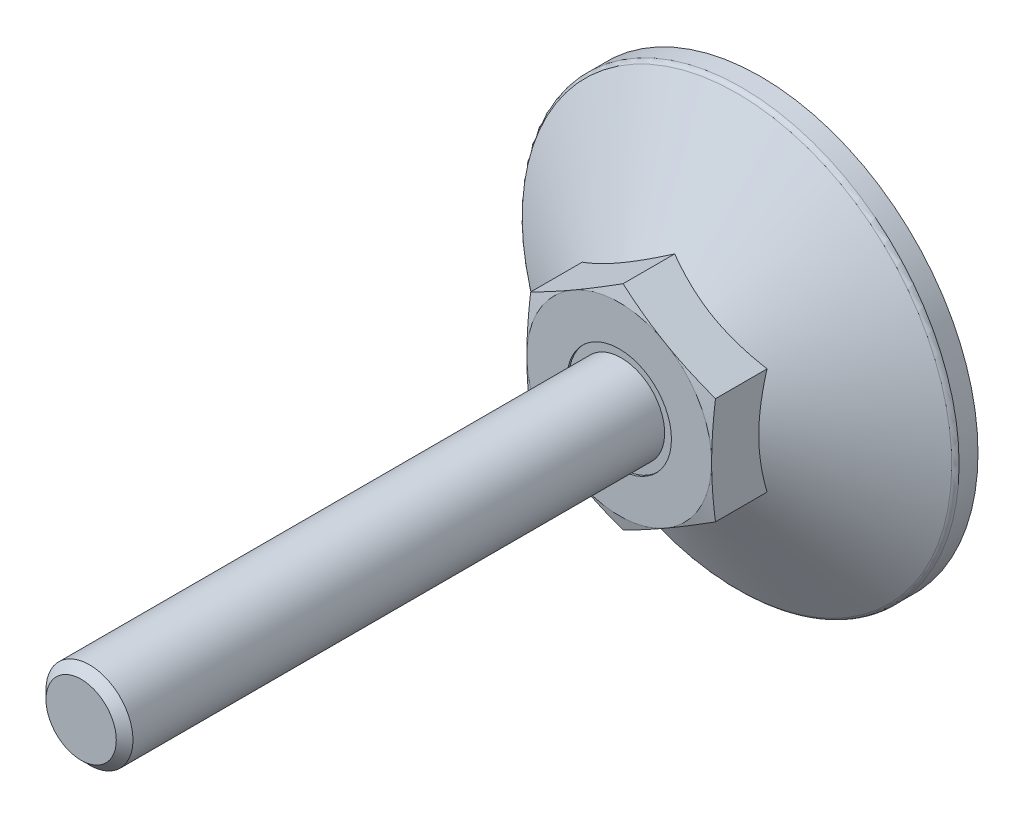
ISO-10303-21;
HEADER;
FILE_DESCRIPTION(('STEP AP214'),'2;1');
FILE_NAME('part.step','',(''),(''),'','','');
FILE_SCHEMA(('AUTOMOTIVE_DESIGN { 1 0 10303 214 1 1 1 1 }'));
ENDSEC;
DATA;
#1=APPLICATION_CONTEXT('core data for automotive mechanical design processes');
#2=APPLICATION_PROTOCOL_DEFINITION('international standard','automotive_design',2000,#1);
#3=PRODUCT_CONTEXT('',#1,'mechanical');
#4=PRODUCT('Part','Part','',(#3));
#5=PRODUCT_RELATED_PRODUCT_CATEGORY('part','',(#4));
#6=PRODUCT_DEFINITION_FORMATION('','',#4);
#7=PRODUCT_DEFINITION_CONTEXT('part definition',#1,'design');
#8=PRODUCT_DEFINITION('design','',#6,#7);
#9=PRODUCT_DEFINITION_SHAPE('','',#8);
#10=(LENGTH_UNIT() NAMED_UNIT(*) SI_UNIT(.MILLI.,.METRE.));
#11=(NAMED_UNIT(*) PLANE_ANGLE_UNIT() SI_UNIT($,.RADIAN.));
#12=(NAMED_UNIT(*) SI_UNIT($,.STERADIAN.) SOLID_ANGLE_UNIT());
#13=UNCERTAINTY_MEASURE_WITH_UNIT(LENGTH_MEASURE(1.E-05),#10,'distance_accuracy_value','');
#14=(GEOMETRIC_REPRESENTATION_CONTEXT(3) GLOBAL_UNCERTAINTY_ASSIGNED_CONTEXT((#13)) GLOBAL_UNIT_ASSIGNED_CONTEXT((#10,
#11,#12)) REPRESENTATION_CONTEXT('',''));
#15=CARTESIAN_POINT('',(0.,0.,0.));
#16=DIRECTION('',(0.,0.,1.));
#17=DIRECTION('',(1.,0.,0.));
#18=AXIS2_PLACEMENT_3D('',#15,#16,#17);
#19=CARTESIAN_POINT('',(0.,9.8149545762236,27.));
#20=DIRECTION('',(0.5,-0.86602540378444,0.));
#21=DIRECTION('',(0.86602540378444,0.5,0.));
#22=AXIS2_PLACEMENT_3D('',#19,#20,#21);
#23=PLANE('',#22);
#24=CARTESIAN_POINT('',(0.0002,9.81507004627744,12.6476280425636));
#25=CARTESIAN_POINT('',(-0.352800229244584,9.61126526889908,12.7022599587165));
#26=CARTESIAN_POINT('',(-0.706440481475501,9.40709097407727,12.7518566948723));
#27=CARTESIAN_POINT('',(-1.41496987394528,8.99802133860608,12.8389934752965));
#28=CARTESIAN_POINT('',(-1.76985946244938,8.79312573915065,12.8765286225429));
#29=CARTESIAN_POINT('',(-2.47873586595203,8.38385575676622,12.9373509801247));
#30=CARTESIAN_POINT('',(-2.83271788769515,8.17948414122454,12.9607107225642));
#31=CARTESIAN_POINT('',(-3.5411333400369,7.77048028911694,12.9920337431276));
#32=CARTESIAN_POINT('',(-3.89556667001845,7.56584811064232,13.));
#33=CARTESIAN_POINT('',(-4.60443332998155,7.15658375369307,13.));
#34=CARTESIAN_POINT('',(-4.9588666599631,6.95195157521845,12.9920337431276));
#35=CARTESIAN_POINT('',(-5.66728211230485,6.54294772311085,12.9607107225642));
#36=CARTESIAN_POINT('',(-6.02126413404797,6.33857610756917,12.9373509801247));
#37=CARTESIAN_POINT('',(-6.73014053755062,5.92930612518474,12.8765286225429));
#38=CARTESIAN_POINT('',(-7.08503012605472,5.7244105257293,12.8389934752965));
#39=CARTESIAN_POINT('',(-7.7935595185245,5.31534089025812,12.7518566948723));
#40=CARTESIAN_POINT('',(-8.14719977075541,5.11116659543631,12.7022599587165));
#41=CARTESIAN_POINT('',(-8.5002,4.90736181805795,12.6476280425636));
#42=B_SPLINE_CURVE_WITH_KNOTS('',3,(#24,#25,#26,#27,#28,#29,#30,#31,#32,#33,#34,#35,#36,#37,#38,
#39,#40,#41),.UNSPECIFIED.,.F.,.F.,(4,2,2,2,2,2,2,2,4),(0.,1.23382789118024,2.46815608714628,
3.69611406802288,4.92383440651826,6.15155474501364,7.37951272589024,8.61384092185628,
9.84766881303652),.UNSPECIFIED.);
#43=CARTESIAN_POINT('',(0.,9.8149545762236,12.6476589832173));
#44=VERTEX_POINT('',#43);
#45=CARTESIAN_POINT('',(-4.25,7.36121593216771,13.));
#46=VERTEX_POINT('',#45);
#47=EDGE_CURVE('E269',#44,#46,#42,.T.);
#48=ORIENTED_EDGE('',*,*,#47,.F.);
#49=DIRECTION('',(0.,0.,-1.));
#50=VECTOR('',#49,1.);
#51=CARTESIAN_POINT('',(0.,9.8149545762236,27.));
#52=LINE('',#51,#50);
#53=CARTESIAN_POINT('',(0.,9.8149545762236,7.90533871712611));
#54=VERTEX_POINT('',#53);
#55=EDGE_CURVE('E43',#44,#54,#52,.T.);
#56=ORIENTED_EDGE('',*,*,#55,.T.);
#57=CARTESIAN_POINT('',(-8.5002,4.90736181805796,7.90527204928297));
#58=CARTESIAN_POINT('',(-8.31336077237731,5.0152334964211,7.96754195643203));
#59=CARTESIAN_POINT('',(-8.1258249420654,5.12350735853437,8.02698579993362));
#60=CARTESIAN_POINT('',(-7.74923024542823,5.34093440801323,8.13944298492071));
#61=CARTESIAN_POINT('',(-7.56017075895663,5.45008795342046,8.19245355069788));
#62=CARTESIAN_POINT('',(-6.98996524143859,5.77929626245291,8.34079470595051));
#63=CARTESIAN_POINT('',(-6.60656835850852,6.00065055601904,8.42516916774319));
#64=CARTESIAN_POINT('',(-6.03282233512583,6.33190297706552,8.52410807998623));
#65=CARTESIAN_POINT('',(-5.8441872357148,6.44081150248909,8.55229289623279));
#66=CARTESIAN_POINT('',(-5.46606397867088,6.65912106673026,8.59955401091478));
#67=CARTESIAN_POINT('',(-5.27657589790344,6.76852206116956,8.61863111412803));
#68=CARTESIAN_POINT('',(-4.89727347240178,6.98751241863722,8.64719332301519));
#69=CARTESIAN_POINT('',(-4.70745974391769,7.0971014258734,8.65668931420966));
#70=CARTESIAN_POINT('',(-4.3276569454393,7.31638067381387,8.66588571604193));
#71=CARTESIAN_POINT('',(-4.13766788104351,7.42607091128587,8.66558642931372));
#72=CARTESIAN_POINT('',(-3.78247698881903,7.63114046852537,8.65587362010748));
#73=CARTESIAN_POINT('',(-3.61725009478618,7.7265342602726,8.64764492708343));
#74=CARTESIAN_POINT('',(-3.28718328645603,7.91709842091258,8.62393885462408));
#75=CARTESIAN_POINT('',(-3.12234339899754,8.01226877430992,8.60846098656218));
#76=CARTESIAN_POINT('',(-2.62846189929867,8.29741139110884,8.55151947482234));
#77=CARTESIAN_POINT('',(-2.30029449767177,8.48687892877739,8.49955503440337));
#78=CARTESIAN_POINT('',(-1.64047857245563,8.86782383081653,8.36964315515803));
#79=CARTESIAN_POINT('',(-1.30891425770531,9.0592525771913,8.29114502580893));
#80=CARTESIAN_POINT('',(-0.650730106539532,9.43925537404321,8.11298675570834));
#81=CARTESIAN_POINT('',(-0.324101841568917,9.62783429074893,8.01336845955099));
#82=CARTESIAN_POINT('',(0.000199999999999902,9.81507004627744,7.90527204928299));
#83=B_SPLINE_CURVE_WITH_KNOTS('',3,(#57,#58,#59,#60,#61,#62,#63,#64,#65,#66,#67,#68,#69,#70,#71,
#72,#73,#74,#75,#76,#77,#78,#79,#80,#81,#82),.UNSPECIFIED.,.F.,.F.,(4,2,2,2,2,2,2,2,2,2,2,2,4),
(0.,0.673596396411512,1.34748239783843,2.69805431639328,3.35679995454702,4.01548737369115,
4.67342558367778,5.33134346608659,5.90409556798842,6.47688628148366,7.62328361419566,
8.79510569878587,9.96462743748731),.UNSPECIFIED.);
#84=CARTESIAN_POINT('',(-8.5,4.9074772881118,7.90533871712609));
#85=VERTEX_POINT('',#84);
#86=EDGE_CURVE('E237',#85,#54,#83,.T.);
#87=ORIENTED_EDGE('',*,*,#86,.F.);
#88=DIRECTION('',(0.,0.,-1.));
#89=VECTOR('',#88,1.);
#90=CARTESIAN_POINT('',(-8.5,4.9074772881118,27.));
#91=LINE('',#90,#89);
#92=CARTESIAN_POINT('',(-8.5,4.9074772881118,12.6476589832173));
#93=VERTEX_POINT('',#92);
#94=EDGE_CURVE('E282',#93,#85,#91,.T.);
#95=ORIENTED_EDGE('',*,*,#94,.F.);
#96=EDGE_CURVE('E169',#46,#93,#42,.T.);
#97=ORIENTED_EDGE('',*,*,#96,.F.);
#98=EDGE_LOOP('',(#48,#56,#87,#95,#97));
#99=FACE_BOUND('',#98,.T.);
#100=ADVANCED_FACE('F14',(#99),#23,.F.);
#101=CARTESIAN_POINT('',(8.5,4.9074772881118,27.));
#102=DIRECTION('',(-0.5,-0.86602540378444,0.));
#103=DIRECTION('',(0.86602540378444,-0.5,0.));
#104=AXIS2_PLACEMENT_3D('',#101,#102,#103);
#105=PLANE('',#104);
#106=CARTESIAN_POINT('',(8.5002,4.90736181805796,12.6476280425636));
#107=CARTESIAN_POINT('',(8.14719977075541,5.11116659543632,12.7022599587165));
#108=CARTESIAN_POINT('',(7.7935595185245,5.31534089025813,12.7518566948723));
#109=CARTESIAN_POINT('',(7.08503012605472,5.72441052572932,12.8389934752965));
#110=CARTESIAN_POINT('',(6.73014053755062,5.92930612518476,12.8765286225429));
#111=CARTESIAN_POINT('',(6.02126413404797,6.33857610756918,12.9373509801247));
#112=CARTESIAN_POINT('',(5.66728211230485,6.54294772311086,12.9607107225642));
#113=CARTESIAN_POINT('',(4.9588666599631,6.95195157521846,12.9920337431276));
#114=CARTESIAN_POINT('',(4.60443332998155,7.15658375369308,13.));
#115=CARTESIAN_POINT('',(3.89556667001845,7.56584811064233,13.));
#116=CARTESIAN_POINT('',(3.5411333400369,7.77048028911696,12.9920337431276));
#117=CARTESIAN_POINT('',(2.83271788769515,8.17948414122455,12.9607107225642));
#118=CARTESIAN_POINT('',(2.47873586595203,8.38385575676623,12.9373509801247));
#119=CARTESIAN_POINT('',(1.76985946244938,8.79312573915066,12.8765286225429));
#120=CARTESIAN_POINT('',(1.41496987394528,8.9980213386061,12.8389934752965));
#121=CARTESIAN_POINT('',(0.706440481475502,9.40709097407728,12.7518566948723));
#122=CARTESIAN_POINT('',(0.352800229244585,9.61126526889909,12.7022599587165));
#123=CARTESIAN_POINT('',(-0.000200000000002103,9.81507004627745,12.6476280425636));
#124=B_SPLINE_CURVE_WITH_KNOTS('',3,(#106,#107,#108,#109,#110,#111,#112,#113,#114,#115,#116,
#117,#118,#119,#120,#121,#122,#123),.UNSPECIFIED.,.F.,.F.,(4,2,2,2,2,2,2,2,4),(0.,
1.23382789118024,2.46815608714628,3.69611406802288,4.92383440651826,6.15155474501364,
7.37951272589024,8.61384092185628,9.84766881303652),.UNSPECIFIED.);
#125=CARTESIAN_POINT('',(8.5,4.9074772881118,12.6476589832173));
#126=VERTEX_POINT('',#125);
#127=CARTESIAN_POINT('',(4.25,7.36121593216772,13.));
#128=VERTEX_POINT('',#127);
#129=EDGE_CURVE('E121',#126,#128,#124,.T.);
#130=ORIENTED_EDGE('',*,*,#129,.F.);
#131=DIRECTION('',(0.,0.,-1.));
#132=VECTOR('',#131,1.);
#133=CARTESIAN_POINT('',(8.5,4.9074772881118,27.));
#134=LINE('',#133,#132);
#135=CARTESIAN_POINT('',(8.5,4.9074772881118,7.90533871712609));
#136=VERTEX_POINT('',#135);
#137=EDGE_CURVE('E128',#126,#136,#134,.T.);
#138=ORIENTED_EDGE('',*,*,#137,.T.);
#139=CARTESIAN_POINT('',(-0.0002,9.81507004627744,7.90527204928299));
#140=CARTESIAN_POINT('',(0.186639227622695,9.7071983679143,7.96754195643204));
#141=CARTESIAN_POINT('',(0.374175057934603,9.59892450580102,8.02698579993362));
#142=CARTESIAN_POINT('',(0.750769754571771,9.38149745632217,8.13944298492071));
#143=CARTESIAN_POINT('',(0.939829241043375,9.27234391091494,8.19245355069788));
#144=CARTESIAN_POINT('',(1.51003475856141,8.94313560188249,8.34079470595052));
#145=CARTESIAN_POINT('',(1.89343164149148,8.72178130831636,8.42516916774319));
#146=CARTESIAN_POINT('',(2.46717766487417,8.39052888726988,8.52410807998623));
#147=CARTESIAN_POINT('',(2.6558127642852,8.28162036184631,8.55229289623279));
#148=CARTESIAN_POINT('',(3.03393602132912,8.06331079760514,8.59955401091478));
#149=CARTESIAN_POINT('',(3.22342410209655,7.95390980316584,8.61863111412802));
#150=CARTESIAN_POINT('',(3.60272652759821,7.73491944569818,8.64719332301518));
#151=CARTESIAN_POINT('',(3.79254025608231,7.62533043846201,8.65668931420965));
#152=CARTESIAN_POINT('',(4.1723430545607,7.40605119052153,8.66588571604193));
#153=CARTESIAN_POINT('',(4.36233211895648,7.29636095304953,8.66558642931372));
#154=CARTESIAN_POINT('',(4.71752301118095,7.09129139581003,8.65587362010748));
#155=CARTESIAN_POINT('',(4.88274990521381,6.9958976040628,8.64764492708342));
#156=CARTESIAN_POINT('',(5.21281671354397,6.80533344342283,8.62393885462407));
#157=CARTESIAN_POINT('',(5.37765660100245,6.71016309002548,8.60846098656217));
#158=CARTESIAN_POINT('',(5.87153810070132,6.42502047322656,8.55151947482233));
#159=CARTESIAN_POINT('',(6.19970550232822,6.23555293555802,8.49955503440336));
#160=CARTESIAN_POINT('',(6.85952142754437,5.85460803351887,8.36964315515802));
#161=CARTESIAN_POINT('',(7.19108574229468,5.6631792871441,8.29114502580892));
#162=CARTESIAN_POINT('',(7.84926989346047,5.28317649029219,8.11298675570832));
#163=CARTESIAN_POINT('',(8.17589815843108,5.09459757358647,8.01336845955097));
#164=CARTESIAN_POINT('',(8.5002,4.90736181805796,7.90527204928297));
#165=B_SPLINE_CURVE_WITH_KNOTS('',3,(#139,#140,#141,#142,#143,#144,#145,#146,#147,#148,#149,
#150,#151,#152,#153,#154,#155,#156,#157,#158,#159,#160,#161,#162,#163,#164),.UNSPECIFIED.,.F.,
.F.,(4,2,2,2,2,2,2,2,2,2,2,2,4),(0.,0.673596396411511,1.34748239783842,2.69805431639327,
3.35679995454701,4.01548737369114,4.67342558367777,5.33134346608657,5.90409556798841,
6.47688628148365,7.62328361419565,8.79510569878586,9.96462743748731),.UNSPECIFIED.);
#166=EDGE_CURVE('E231',#54,#136,#165,.T.);
#167=ORIENTED_EDGE('',*,*,#166,.F.);
#168=ORIENTED_EDGE('',*,*,#55,.F.);
#169=EDGE_CURVE('E138',#128,#44,#124,.T.);
#170=ORIENTED_EDGE('',*,*,#169,.F.);
#171=EDGE_LOOP('',(#130,#138,#167,#168,#170));
#172=FACE_BOUND('',#171,.T.);
#173=ADVANCED_FACE('F243',(#172),#105,.F.);
#174=CARTESIAN_POINT('',(8.5,-4.9074772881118,27.));
#175=DIRECTION('',(-1.,0.,0.));
#176=DIRECTION('',(0.,-1.,0.));
#177=AXIS2_PLACEMENT_3D('',#174,#175,#176);
#178=PLANE('',#177);
#179=CARTESIAN_POINT('',(8.5,-13.0021805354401,11.1152320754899));
#180=CARTESIAN_POINT('',(8.5,-12.6163302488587,11.2017460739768));
#181=CARTESIAN_POINT('',(8.5,-12.2302391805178,11.2872053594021));
#182=CARTESIAN_POINT('',(8.5,-11.4574571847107,11.4554451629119));
#183=CARTESIAN_POINT('',(8.5,-11.0707662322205,11.5382255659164));
#184=CARTESIAN_POINT('',(8.5,-10.2963226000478,11.7006097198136));
#185=CARTESIAN_POINT('',(8.5,-9.90856925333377,11.7802103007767));
#186=CARTESIAN_POINT('',(8.5,-9.13225694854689,11.9353788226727));
#187=CARTESIAN_POINT('',(8.5,-8.7436979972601,12.0109467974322));
#188=CARTESIAN_POINT('',(8.5,-7.96872954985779,12.1565076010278));
#189=CARTESIAN_POINT('',(8.5,-7.58232751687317,12.2265399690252));
#190=CARTESIAN_POINT('',(8.5,-6.80847058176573,12.3605125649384));
#191=CARTESIAN_POINT('',(8.5,-6.42101570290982,12.4244529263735));
#192=CARTESIAN_POINT('',(8.5,-5.64497545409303,12.5448060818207));
#193=CARTESIAN_POINT('',(8.5,-5.25639022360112,12.6012197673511));
#194=CARTESIAN_POINT('',(8.5,-4.4779825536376,12.7048608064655));
#195=CARTESIAN_POINT('',(8.5,-4.08816011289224,12.7520881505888));
#196=CARTESIAN_POINT('',(8.5,-3.30287168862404,12.8360235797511));
#197=CARTESIAN_POINT('',(8.5,-2.90739202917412,12.8726056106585));
#198=CARTESIAN_POINT('',(8.5,-2.11543412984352,12.9327294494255));
#199=CARTESIAN_POINT('',(8.5,-1.71895591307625,12.9562715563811));
#200=CARTESIAN_POINT('',(8.5,-0.925576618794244,12.988942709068));
#201=CARTESIAN_POINT('',(8.5,-0.528675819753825,12.9980783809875));
#202=CARTESIAN_POINT('',(8.5,0.265188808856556,13.0013745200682));
#203=CARTESIAN_POINT('',(8.5,0.662152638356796,12.9955350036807));
#204=CARTESIAN_POINT('',(8.5,1.4570313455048,12.969208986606));
#205=CARTESIAN_POINT('',(8.5,1.85494442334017,12.9486692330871));
#206=CARTESIAN_POINT('',(8.5,2.64983744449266,12.8941170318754));
#207=CARTESIAN_POINT('',(8.5,3.0468173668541,12.8601042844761));
#208=CARTESIAN_POINT('',(8.5,3.83984026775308,12.780329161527));
#209=CARTESIAN_POINT('',(8.5,4.23588245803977,12.7345590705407));
#210=CARTESIAN_POINT('',(8.5,5.02669148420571,12.6331799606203));
#211=CARTESIAN_POINT('',(8.5,5.42145831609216,12.5775709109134));
#212=CARTESIAN_POINT('',(8.5,6.18517456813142,12.4620180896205));
#213=CARTESIAN_POINT('',(8.5,6.55419838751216,12.4025610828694));
#214=CARTESIAN_POINT('',(8.5,7.29126861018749,12.2778421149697));
#215=CARTESIAN_POINT('',(8.5,7.65931498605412,12.2125799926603));
#216=CARTESIAN_POINT('',(8.5,8.39456605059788,12.0773157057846));
#217=CARTESIAN_POINT('',(8.5,8.76177065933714,12.0073131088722));
#218=CARTESIAN_POINT('',(8.5,9.49542419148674,11.8634431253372));
#219=CARTESIAN_POINT('',(8.5,9.86187310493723,11.7895756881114));
#220=CARTESIAN_POINT('',(8.5,10.5942023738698,11.6386609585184));
#221=CARTESIAN_POINT('',(8.5,10.9600825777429,11.5616129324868));
#222=CARTESIAN_POINT('',(8.5,11.6912848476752,11.4049086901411));
#223=CARTESIAN_POINT('',(8.5,12.0566069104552,11.3252524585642));
#224=CARTESIAN_POINT('',(8.5,13.1518112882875,11.0830781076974));
#225=CARTESIAN_POINT('',(8.5,13.8809821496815,10.9173438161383));
#226=CARTESIAN_POINT('',(8.5,15.3307543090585,10.5815635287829));
#227=CARTESIAN_POINT('',(8.5,16.051369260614,10.4115760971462));
#228=CARTESIAN_POINT('',(8.5,17.4915955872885,10.0673505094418));
#229=CARTESIAN_POINT('',(8.5,18.2112069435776,9.89311227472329));
#230=CARTESIAN_POINT('',(8.5,19.6487634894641,9.54172135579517));
#231=CARTESIAN_POINT('',(8.5,20.3667096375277,9.36457258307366));
#232=CARTESIAN_POINT('',(8.5,21.8019779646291,9.00786472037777));
#233=CARTESIAN_POINT('',(8.5,22.5193001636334,8.82830571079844));
#234=CARTESIAN_POINT('',(8.5,23.2364053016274,8.64789358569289));
#235=B_SPLINE_CURVE_WITH_KNOTS('',3,(#179,#180,#181,#182,#183,#184,#185,#186,#187,#188,#189,
#190,#191,#192,#193,#194,#195,#196,#197,#198,#199,#200,#201,#202,#203,#204,#205,#206,#207,#208,
#209,#210,#211,#212,#213,#214,#215,#216,#217,#218,#219,#220,#221,#222,#223,#224,#225,#226,#227,
#228,#229,#230,#231,#232,#233,#234),.UNSPECIFIED.,.F.,.F.,(4,2,2,2,2,2,2,2,2,2,2,2,2,2,2,2,2,2,
2,2,2,2,2,2,2,2,2,4),(0.,1.18629567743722,2.37264224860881,3.56014337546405,4.74763453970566,
5.92568709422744,7.10371382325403,8.28160089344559,9.45948917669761,10.6508050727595,
11.84209364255,13.0328341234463,14.2235732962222,15.418647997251,16.613749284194,
17.809636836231,19.0055281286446,20.126822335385,21.2481476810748,22.3695754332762,
23.4910178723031,24.6127204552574,25.7344296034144,27.9776935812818,30.1988572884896,
32.4200621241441,34.6384929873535,36.8568500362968),.UNSPECIFIED.);
#236=CARTESIAN_POINT('',(8.5,-4.90747728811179,12.6476589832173));
#237=VERTEX_POINT('',#236);
#238=CARTESIAN_POINT('',(8.5,0.,13.));
#239=VERTEX_POINT('',#238);
#240=EDGE_CURVE('E95',#237,#239,#235,.T.);
#241=ORIENTED_EDGE('',*,*,#240,.F.);
#242=DIRECTION('',(0.,0.,-1.));
#243=VECTOR('',#242,1.);
#244=CARTESIAN_POINT('',(8.5,-4.9074772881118,27.));
#245=LINE('',#244,#243);
#246=CARTESIAN_POINT('',(8.5,-4.9074772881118,7.90533871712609));
#247=VERTEX_POINT('',#246);
#248=EDGE_CURVE('E275',#237,#247,#245,.T.);
#249=ORIENTED_EDGE('',*,*,#248,.T.);
#250=CARTESIAN_POINT('',(8.5,12.7492767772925,4.72527230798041));
#251=CARTESIAN_POINT('',(8.5,12.3811478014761,4.90206026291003));
#252=CARTESIAN_POINT('',(8.5,12.0121249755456,5.07702151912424));
#253=CARTESIAN_POINT('',(8.5,11.2718137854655,5.42225230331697));
#254=CARTESIAN_POINT('',(8.5,10.9005250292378,5.59252098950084));
#255=CARTESIAN_POINT('',(8.5,10.1530767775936,5.92827896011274));
#256=CARTESIAN_POINT('',(8.5,9.77690140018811,6.09373302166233));
#257=CARTESIAN_POINT('',(8.5,9.02139912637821,6.41725455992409));
#258=CARTESIAN_POINT('',(8.5,8.64207239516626,6.57532242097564));
#259=CARTESIAN_POINT('',(8.5,7.86979942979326,6.88607334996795));
#260=CARTESIAN_POINT('',(8.5,7.47675434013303,7.03851219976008));
#261=CARTESIAN_POINT('',(8.5,6.68591204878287,7.33076935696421));
#262=CARTESIAN_POINT('',(8.5,6.28811429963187,7.47058619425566));
#263=CARTESIAN_POINT('',(8.5,5.48802263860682,7.733611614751));
#264=CARTESIAN_POINT('',(8.5,5.08574124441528,7.85685783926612));
#265=CARTESIAN_POINT('',(8.5,4.27544970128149,8.08251258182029));
#266=CARTESIAN_POINT('',(8.5,3.86744153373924,8.18492812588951));
#267=CARTESIAN_POINT('',(8.5,3.04728386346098,8.36327495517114));
#268=CARTESIAN_POINT('',(8.5,2.6351585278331,8.43931422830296));
#269=CARTESIAN_POINT('',(8.5,2.01359122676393,8.53003978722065));
#270=CARTESIAN_POINT('',(8.5,1.80582110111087,8.55639399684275));
#271=CARTESIAN_POINT('',(8.5,1.38940213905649,8.60080126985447));
#272=CARTESIAN_POINT('',(8.5,1.18075338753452,8.61885511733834));
#273=CARTESIAN_POINT('',(8.5,0.765376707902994,8.64609671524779));
#274=CARTESIAN_POINT('',(8.5,0.558655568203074,8.65538769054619));
#275=CARTESIAN_POINT('',(8.5,0.1450067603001,8.66526416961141));
#276=CARTESIAN_POINT('',(8.5,-0.0619209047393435,8.6658498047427));
#277=CARTESIAN_POINT('',(8.5,-0.475626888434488,8.65830085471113));
#278=CARTESIAN_POINT('',(8.5,-0.682405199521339,8.65016585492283));
#279=CARTESIAN_POINT('',(8.5,-1.09545270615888,8.625363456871));
#280=CARTESIAN_POINT('',(8.5,-1.30172187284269,8.60869558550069));
#281=CARTESIAN_POINT('',(8.5,-1.81090940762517,8.55735076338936));
#282=CARTESIAN_POINT('',(8.5,-2.11335210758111,8.51788364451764));
#283=CARTESIAN_POINT('',(8.5,-2.71570235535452,8.4228634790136));
#284=CARTESIAN_POINT('',(8.5,-3.01560949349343,8.36730788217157));
#285=CARTESIAN_POINT('',(8.5,-3.61268959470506,8.2420877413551));
#286=CARTESIAN_POINT('',(8.5,-3.90986014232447,8.17241178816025));
#287=CARTESIAN_POINT('',(8.5,-4.50108875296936,8.02104250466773));
#288=CARTESIAN_POINT('',(8.5,-4.79514688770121,7.93934945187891));
#289=CARTESIAN_POINT('',(8.5,-5.3871494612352,7.7638116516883));
#290=CARTESIAN_POINT('',(8.5,-5.68502188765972,7.6697256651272));
#291=CARTESIAN_POINT('',(8.5,-6.27782977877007,7.4727599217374));
#292=CARTESIAN_POINT('',(8.5,-6.57276522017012,7.36988009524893));
#293=CARTESIAN_POINT('',(8.5,-7.15987047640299,7.15687683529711));
#294=CARTESIAN_POINT('',(8.5,-7.45204129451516,7.04675615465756));
#295=CARTESIAN_POINT('',(8.5,-8.03401937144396,6.82048197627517));
#296=CARTESIAN_POINT('',(8.5,-8.32382669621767,6.70432864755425));
#297=CARTESIAN_POINT('',(8.5,-8.8985343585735,6.468166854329));
#298=CARTESIAN_POINT('',(8.5,-9.18345493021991,6.34820749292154));
#299=CARTESIAN_POINT('',(8.5,-9.75152375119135,6.10415692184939));
#300=CARTESIAN_POINT('',(8.5,-10.034671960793,5.98006561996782));
#301=CARTESIAN_POINT('',(8.5,-10.8818575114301,5.60257794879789));
#302=CARTESIAN_POINT('',(8.5,-11.4435817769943,5.34399030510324));
#303=CARTESIAN_POINT('',(8.5,-12.5625477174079,4.81675169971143));
#304=CARTESIAN_POINT('',(8.5,-13.1197873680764,4.54809647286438));
#305=CARTESIAN_POINT('',(8.5,-14.2306052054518,4.00340707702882));
#306=CARTESIAN_POINT('',(8.5,-14.7841835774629,3.72737328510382));
#307=CARTESIAN_POINT('',(8.5,-15.8894273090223,3.16924748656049));
#308=CARTESIAN_POINT('',(8.5,-16.4410879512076,2.88714616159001));
#309=CARTESIAN_POINT('',(8.5,-17.5421722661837,2.31860293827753));
#310=CARTESIAN_POINT('',(8.5,-18.0915959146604,2.03216099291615));
#311=CARTESIAN_POINT('',(8.5,-19.1885131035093,1.45593769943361));
#312=CARTESIAN_POINT('',(8.5,-19.7360070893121,1.1661571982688));
#313=CARTESIAN_POINT('',(8.5,-20.8295421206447,0.583866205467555));
#314=CARTESIAN_POINT('',(8.5,-21.3755831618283,0.291355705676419));
#315=CARTESIAN_POINT('',(8.5,-22.8810608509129,-0.519031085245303));
#316=CARTESIAN_POINT('',(8.5,-23.8392547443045,-1.03921546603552));
#317=CARTESIAN_POINT('',(8.5,-25.7530641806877,-2.08445783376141));
#318=CARTESIAN_POINT('',(8.5,-26.708679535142,-2.60951616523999));
#319=CARTESIAN_POINT('',(8.5,-28.6148788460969,-3.66152013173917));
#320=CARTESIAN_POINT('',(8.5,-29.565469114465,-4.18845433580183));
#321=CARTESIAN_POINT('',(8.5,-30.9901906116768,-4.98085413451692));
#322=CARTESIAN_POINT('',(8.5,-31.4648842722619,-5.24530955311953));
#323=CARTESIAN_POINT('',(8.5,-32.4139385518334,-5.77481644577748));
#324=CARTESIAN_POINT('',(8.5,-32.8882991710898,-6.03986791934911));
#325=CARTESIAN_POINT('',(8.5,-33.3625145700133,-6.30517901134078));
#326=B_SPLINE_CURVE_WITH_KNOTS('',3,(#250,#251,#252,#253,#254,#255,#256,#257,#258,#259,#260,
#261,#262,#263,#264,#265,#266,#267,#268,#269,#270,#271,#272,#273,#274,#275,#276,#277,#278,#279,
#280,#281,#282,#283,#284,#285,#286,#287,#288,#289,#290,#291,#292,#293,#294,#295,#296,#297,#298,
#299,#300,#301,#302,#303,#304,#305,#306,#307,#308,#309,#310,#311,#312,#313,#314,#315,#316,#317,
#318,#319,#320,#321,#322,#323,#324,#325),.UNSPECIFIED.,.F.,.F.,(4,2,2,2,2,2,2,2,2,2,2,2,2,2,2,2,
2,2,2,2,2,2,2,2,2,2,2,2,2,2,2,2,2,2,2,2,2,4),(0.,1.22515253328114,2.45052343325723,
3.6833213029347,4.91605495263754,6.18059988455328,7.44529191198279,8.70706073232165,
9.96840325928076,11.2245189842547,11.852683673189,12.4807890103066,13.1013994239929,
13.7220004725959,14.3426310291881,14.9632960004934,15.8778021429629,16.7924533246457,
17.7078465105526,18.6232185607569,19.5601888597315,20.4971665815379,21.433790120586,
22.3703874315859,23.297780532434,24.225194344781,26.0801973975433,27.9359954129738,
29.7916987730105,31.6504906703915,33.5093027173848,35.3676531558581,37.2260091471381,
40.4968499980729,43.7679238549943,47.0285209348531,48.6586852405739,50.2888482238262),.UNSPECIFIED.);
#327=EDGE_CURVE('E197',#136,#247,#326,.T.);
#328=ORIENTED_EDGE('',*,*,#327,.F.);
#329=ORIENTED_EDGE('',*,*,#137,.F.);
#330=EDGE_CURVE('E106',#239,#126,#235,.T.);
#331=ORIENTED_EDGE('',*,*,#330,.F.);
#332=EDGE_LOOP('',(#241,#249,#328,#329,#331));
#333=FACE_BOUND('',#332,.T.);
#334=ADVANCED_FACE('F126',(#333),#178,.F.);
#335=CARTESIAN_POINT('',(0.,-9.8149545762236,27.));
#336=DIRECTION('',(-0.5,0.86602540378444,0.));
#337=DIRECTION('',(-0.86602540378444,-0.5,0.));
#338=AXIS2_PLACEMENT_3D('',#335,#336,#337);
#339=PLANE('',#338);
#340=CARTESIAN_POINT('',(-0.0002,-9.81507004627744,12.6476280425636));
#341=CARTESIAN_POINT('',(0.352800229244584,-9.61126526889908,12.7022599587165));
#342=CARTESIAN_POINT('',(0.706440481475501,-9.40709097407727,12.7518566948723));
#343=CARTESIAN_POINT('',(1.41496987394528,-8.99802133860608,12.8389934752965));
#344=CARTESIAN_POINT('',(1.76985946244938,-8.79312573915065,12.8765286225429));
#345=CARTESIAN_POINT('',(2.47873586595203,-8.38385575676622,12.9373509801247));
#346=CARTESIAN_POINT('',(2.83271788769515,-8.17948414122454,12.9607107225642));
#347=CARTESIAN_POINT('',(3.5411333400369,-7.77048028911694,12.9920337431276));
#348=CARTESIAN_POINT('',(3.89556667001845,-7.56584811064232,13.));
#349=CARTESIAN_POINT('',(4.60443332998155,-7.15658375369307,13.));
#350=CARTESIAN_POINT('',(4.9588666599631,-6.95195157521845,12.9920337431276));
#351=CARTESIAN_POINT('',(5.66728211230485,-6.54294772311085,12.9607107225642));
#352=CARTESIAN_POINT('',(6.02126413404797,-6.33857610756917,12.9373509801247));
#353=CARTESIAN_POINT('',(6.73014053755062,-5.92930612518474,12.8765286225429));
#354=CARTESIAN_POINT('',(7.08503012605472,-5.7244105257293,12.8389934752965));
#355=CARTESIAN_POINT('',(7.7935595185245,-5.31534089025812,12.7518566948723));
#356=CARTESIAN_POINT('',(8.14719977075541,-5.11116659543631,12.7022599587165));
#357=CARTESIAN_POINT('',(8.5002,-4.90736181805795,12.6476280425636));
#358=B_SPLINE_CURVE_WITH_KNOTS('',3,(#340,#341,#342,#343,#344,#345,#346,#347,#348,#349,#350,
#351,#352,#353,#354,#355,#356,#357),.UNSPECIFIED.,.F.,.F.,(4,2,2,2,2,2,2,2,4),(0.,
1.23382789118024,2.46815608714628,3.69611406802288,4.92383440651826,6.15155474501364,
7.37951272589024,8.61384092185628,9.84766881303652),.UNSPECIFIED.);
#359=CARTESIAN_POINT('',(0.,-9.81495457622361,12.6476589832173));
#360=VERTEX_POINT('',#359);
#361=CARTESIAN_POINT('',(4.25,-7.36121593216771,13.));
#362=VERTEX_POINT('',#361);
#363=EDGE_CURVE('E130',#360,#362,#358,.T.);
#364=ORIENTED_EDGE('',*,*,#363,.F.);
#365=DIRECTION('',(0.,0.,-1.));
#366=VECTOR('',#365,1.);
#367=CARTESIAN_POINT('',(0.,-9.8149545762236,27.));
#368=LINE('',#367,#366);
#369=CARTESIAN_POINT('',(0.,-9.8149545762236,7.90533871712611));
#370=VERTEX_POINT('',#369);
#371=EDGE_CURVE('E279',#360,#370,#368,.T.);
#372=ORIENTED_EDGE('',*,*,#371,.T.);
#373=CARTESIAN_POINT('',(8.5002,-4.90736181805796,7.90527204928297));
#374=CARTESIAN_POINT('',(8.31336077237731,-5.0152334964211,7.96754195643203));
#375=CARTESIAN_POINT('',(8.1258249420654,-5.12350735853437,8.02698579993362));
#376=CARTESIAN_POINT('',(7.74923024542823,-5.34093440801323,8.13944298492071));
#377=CARTESIAN_POINT('',(7.56017075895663,-5.45008795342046,8.19245355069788));
#378=CARTESIAN_POINT('',(6.98996524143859,-5.77929626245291,8.34079470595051));
#379=CARTESIAN_POINT('',(6.60656835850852,-6.00065055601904,8.42516916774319));
#380=CARTESIAN_POINT('',(6.03282233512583,-6.33190297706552,8.52410807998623));
#381=CARTESIAN_POINT('',(5.8441872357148,-6.44081150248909,8.55229289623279));
#382=CARTESIAN_POINT('',(5.46606397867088,-6.65912106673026,8.59955401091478));
#383=CARTESIAN_POINT('',(5.27657589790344,-6.76852206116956,8.61863111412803));
#384=CARTESIAN_POINT('',(4.89727347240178,-6.98751241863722,8.64719332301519));
#385=CARTESIAN_POINT('',(4.70745974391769,-7.0971014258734,8.65668931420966));
#386=CARTESIAN_POINT('',(4.3276569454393,-7.31638067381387,8.66588571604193));
#387=CARTESIAN_POINT('',(4.13766788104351,-7.42607091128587,8.66558642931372));
#388=CARTESIAN_POINT('',(3.78247698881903,-7.63114046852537,8.65587362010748));
#389=CARTESIAN_POINT('',(3.61725009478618,-7.7265342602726,8.64764492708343));
#390=CARTESIAN_POINT('',(3.28718328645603,-7.91709842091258,8.62393885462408));
#391=CARTESIAN_POINT('',(3.12234339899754,-8.01226877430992,8.60846098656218));
#392=CARTESIAN_POINT('',(2.62846189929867,-8.29741139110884,8.55151947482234));
#393=CARTESIAN_POINT('',(2.30029449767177,-8.48687892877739,8.49955503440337));
#394=CARTESIAN_POINT('',(1.64047857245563,-8.86782383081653,8.36964315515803));
#395=CARTESIAN_POINT('',(1.30891425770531,-9.0592525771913,8.29114502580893));
#396=CARTESIAN_POINT('',(0.650730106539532,-9.43925537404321,8.11298675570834));
#397=CARTESIAN_POINT('',(0.324101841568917,-9.62783429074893,8.01336845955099));
#398=CARTESIAN_POINT('',(-0.000199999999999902,-9.81507004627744,7.90527204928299));
#399=B_SPLINE_CURVE_WITH_KNOTS('',3,(#373,#374,#375,#376,#377,#378,#379,#380,#381,#382,#383,
#384,#385,#386,#387,#388,#389,#390,#391,#392,#393,#394,#395,#396,#397,#398),.UNSPECIFIED.,.F.,
.F.,(4,2,2,2,2,2,2,2,2,2,2,2,4),(0.,0.673596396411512,1.34748239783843,2.69805431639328,
3.35679995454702,4.01548737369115,4.67342558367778,5.33134346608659,5.90409556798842,
6.47688628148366,7.62328361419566,8.79510569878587,9.96462743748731),.UNSPECIFIED.);
#400=EDGE_CURVE('E188',#247,#370,#399,.T.);
#401=ORIENTED_EDGE('',*,*,#400,.F.);
#402=ORIENTED_EDGE('',*,*,#248,.F.);
#403=EDGE_CURVE('E101',#362,#237,#358,.T.);
#404=ORIENTED_EDGE('',*,*,#403,.F.);
#405=EDGE_LOOP('',(#364,#372,#401,#402,#404));
#406=FACE_BOUND('',#405,.T.);
#407=ADVANCED_FACE('F180',(#406),#339,.F.);
#408=CARTESIAN_POINT('',(-8.5,-4.9074772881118,27.));
#409=DIRECTION('',(0.5,0.86602540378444,0.));
#410=DIRECTION('',(-0.86602540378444,0.5,0.));
#411=AXIS2_PLACEMENT_3D('',#408,#409,#410);
#412=PLANE('',#411);
#413=CARTESIAN_POINT('',(-8.5002,-4.90736181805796,12.6476280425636));
#414=CARTESIAN_POINT('',(-8.14719977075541,-5.11116659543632,12.7022599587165));
#415=CARTESIAN_POINT('',(-7.7935595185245,-5.31534089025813,12.7518566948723));
#416=CARTESIAN_POINT('',(-7.08503012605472,-5.72441052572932,12.8389934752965));
#417=CARTESIAN_POINT('',(-6.73014053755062,-5.92930612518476,12.8765286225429));
#418=CARTESIAN_POINT('',(-6.02126413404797,-6.33857610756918,12.9373509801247));
#419=CARTESIAN_POINT('',(-5.66728211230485,-6.54294772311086,12.9607107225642));
#420=CARTESIAN_POINT('',(-4.9588666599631,-6.95195157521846,12.9920337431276));
#421=CARTESIAN_POINT('',(-4.60443332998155,-7.15658375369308,13.));
#422=CARTESIAN_POINT('',(-3.89556667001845,-7.56584811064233,13.));
#423=CARTESIAN_POINT('',(-3.5411333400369,-7.77048028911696,12.9920337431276));
#424=CARTESIAN_POINT('',(-2.83271788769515,-8.17948414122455,12.9607107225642));
#425=CARTESIAN_POINT('',(-2.47873586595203,-8.38385575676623,12.9373509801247));
#426=CARTESIAN_POINT('',(-1.76985946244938,-8.79312573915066,12.8765286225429));
#427=CARTESIAN_POINT('',(-1.41496987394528,-8.9980213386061,12.8389934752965));
#428=CARTESIAN_POINT('',(-0.706440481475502,-9.40709097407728,12.7518566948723));
#429=CARTESIAN_POINT('',(-0.352800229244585,-9.61126526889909,12.7022599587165));
#430=CARTESIAN_POINT('',(0.000200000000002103,-9.81507004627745,12.6476280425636));
#431=B_SPLINE_CURVE_WITH_KNOTS('',3,(#413,#414,#415,#416,#417,#418,#419,#420,#421,#422,#423,
#424,#425,#426,#427,#428,#429,#430),.UNSPECIFIED.,.F.,.F.,(4,2,2,2,2,2,2,2,4),(0.,
1.23382789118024,2.46815608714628,3.69611406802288,4.92383440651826,6.15155474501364,
7.37951272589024,8.61384092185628,9.84766881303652),.UNSPECIFIED.);
#432=CARTESIAN_POINT('',(-8.5,-4.9074772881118,12.6476589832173));
#433=VERTEX_POINT('',#432);
#434=CARTESIAN_POINT('',(-4.25,-7.36121593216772,13.));
#435=VERTEX_POINT('',#434);
#436=EDGE_CURVE('E161',#433,#435,#431,.T.);
#437=ORIENTED_EDGE('',*,*,#436,.F.);
#438=DIRECTION('',(0.,0.,-1.));
#439=VECTOR('',#438,1.);
#440=CARTESIAN_POINT('',(-8.5,-4.9074772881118,27.));
#441=LINE('',#440,#439);
#442=CARTESIAN_POINT('',(-8.5,-4.9074772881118,7.90533871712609));
#443=VERTEX_POINT('',#442);
#444=EDGE_CURVE('E281',#433,#443,#441,.T.);
#445=ORIENTED_EDGE('',*,*,#444,.T.);
#446=CARTESIAN_POINT('',(0.0002,-9.81507004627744,7.90527204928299));
#447=CARTESIAN_POINT('',(-0.186639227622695,-9.7071983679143,7.96754195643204));
#448=CARTESIAN_POINT('',(-0.374175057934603,-9.59892450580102,8.02698579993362));
#449=CARTESIAN_POINT('',(-0.750769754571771,-9.38149745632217,8.13944298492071));
#450=CARTESIAN_POINT('',(-0.939829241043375,-9.27234391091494,8.19245355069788));
#451=CARTESIAN_POINT('',(-1.51003475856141,-8.94313560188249,8.34079470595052));
#452=CARTESIAN_POINT('',(-1.89343164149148,-8.72178130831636,8.42516916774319));
#453=CARTESIAN_POINT('',(-2.46717766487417,-8.39052888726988,8.52410807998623));
#454=CARTESIAN_POINT('',(-2.6558127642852,-8.28162036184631,8.55229289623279));
#455=CARTESIAN_POINT('',(-3.03393602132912,-8.06331079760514,8.59955401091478));
#456=CARTESIAN_POINT('',(-3.22342410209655,-7.95390980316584,8.61863111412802));
#457=CARTESIAN_POINT('',(-3.60272652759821,-7.73491944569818,8.64719332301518));
#458=CARTESIAN_POINT('',(-3.79254025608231,-7.62533043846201,8.65668931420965));
#459=CARTESIAN_POINT('',(-4.1723430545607,-7.40605119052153,8.66588571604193));
#460=CARTESIAN_POINT('',(-4.36233211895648,-7.29636095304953,8.66558642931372));
#461=CARTESIAN_POINT('',(-4.71752301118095,-7.09129139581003,8.65587362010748));
#462=CARTESIAN_POINT('',(-4.88274990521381,-6.9958976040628,8.64764492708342));
#463=CARTESIAN_POINT('',(-5.21281671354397,-6.80533344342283,8.62393885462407));
#464=CARTESIAN_POINT('',(-5.37765660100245,-6.71016309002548,8.60846098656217));
#465=CARTESIAN_POINT('',(-5.87153810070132,-6.42502047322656,8.55151947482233));
#466=CARTESIAN_POINT('',(-6.19970550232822,-6.23555293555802,8.49955503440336));
#467=CARTESIAN_POINT('',(-6.85952142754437,-5.85460803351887,8.36964315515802));
#468=CARTESIAN_POINT('',(-7.19108574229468,-5.6631792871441,8.29114502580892));
#469=CARTESIAN_POINT('',(-7.84926989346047,-5.28317649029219,8.11298675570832));
#470=CARTESIAN_POINT('',(-8.17589815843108,-5.09459757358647,8.01336845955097));
#471=CARTESIAN_POINT('',(-8.5002,-4.90736181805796,7.90527204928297));
#472=B_SPLINE_CURVE_WITH_KNOTS('',3,(#446,#447,#448,#449,#450,#451,#452,#453,#454,#455,#456,
#457,#458,#459,#460,#461,#462,#463,#464,#465,#466,#467,#468,#469,#470,#471),.UNSPECIFIED.,.F.,
.F.,(4,2,2,2,2,2,2,2,2,2,2,2,4),(0.,0.673596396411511,1.34748239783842,2.69805431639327,
3.35679995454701,4.01548737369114,4.67342558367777,5.33134346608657,5.90409556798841,
6.47688628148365,7.62328361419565,8.79510569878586,9.96462743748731),.UNSPECIFIED.);
#473=EDGE_CURVE('E198',#370,#443,#472,.T.);
#474=ORIENTED_EDGE('',*,*,#473,.F.);
#475=ORIENTED_EDGE('',*,*,#371,.F.);
#476=EDGE_CURVE('E179',#435,#360,#431,.T.);
#477=ORIENTED_EDGE('',*,*,#476,.F.);
#478=EDGE_LOOP('',(#437,#445,#474,#475,#477));
#479=FACE_BOUND('',#478,.T.);
#480=ADVANCED_FACE('F183',(#479),#412,.F.);
#481=CARTESIAN_POINT('',(-8.5,4.9074772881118,27.));
#482=DIRECTION('',(1.,0.,0.));
#483=DIRECTION('',(0.,1.,0.));
#484=AXIS2_PLACEMENT_3D('',#481,#482,#483);
#485=PLANE('',#484);
#486=CARTESIAN_POINT('',(-8.5,-13.0021805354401,11.1152320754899));
#487=CARTESIAN_POINT('',(-8.5,-12.6163302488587,11.2017460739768));
#488=CARTESIAN_POINT('',(-8.5,-12.2302391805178,11.2872053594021));
#489=CARTESIAN_POINT('',(-8.5,-11.4574571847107,11.4554451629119));
#490=CARTESIAN_POINT('',(-8.5,-11.0707662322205,11.5382255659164));
#491=CARTESIAN_POINT('',(-8.5,-10.2963226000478,11.7006097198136));
#492=CARTESIAN_POINT('',(-8.5,-9.90856925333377,11.7802103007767));
#493=CARTESIAN_POINT('',(-8.5,-9.13225694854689,11.9353788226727));
#494=CARTESIAN_POINT('',(-8.5,-8.7436979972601,12.0109467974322));
#495=CARTESIAN_POINT('',(-8.5,-7.96872954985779,12.1565076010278));
#496=CARTESIAN_POINT('',(-8.5,-7.58232751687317,12.2265399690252));
#497=CARTESIAN_POINT('',(-8.5,-6.80847058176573,12.3605125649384));
#498=CARTESIAN_POINT('',(-8.5,-6.42101570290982,12.4244529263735));
#499=CARTESIAN_POINT('',(-8.5,-5.64497545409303,12.5448060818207));
#500=CARTESIAN_POINT('',(-8.5,-5.25639022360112,12.6012197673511));
#501=CARTESIAN_POINT('',(-8.5,-4.4779825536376,12.7048608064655));
#502=CARTESIAN_POINT('',(-8.5,-4.08816011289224,12.7520881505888));
#503=CARTESIAN_POINT('',(-8.5,-3.30287168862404,12.8360235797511));
#504=CARTESIAN_POINT('',(-8.5,-2.90739202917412,12.8726056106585));
#505=CARTESIAN_POINT('',(-8.5,-2.11543412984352,12.9327294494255));
#506=CARTESIAN_POINT('',(-8.5,-1.71895591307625,12.9562715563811));
#507=CARTESIAN_POINT('',(-8.5,-0.925576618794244,12.988942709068));
#508=CARTESIAN_POINT('',(-8.5,-0.528675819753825,12.9980783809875));
#509=CARTESIAN_POINT('',(-8.5,0.265188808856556,13.0013745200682));
#510=CARTESIAN_POINT('',(-8.5,0.662152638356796,12.9955350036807));
#511=CARTESIAN_POINT('',(-8.5,1.4570313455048,12.969208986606));
#512=CARTESIAN_POINT('',(-8.5,1.85494442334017,12.9486692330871));
#513=CARTESIAN_POINT('',(-8.5,2.64983744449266,12.8941170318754));
#514=CARTESIAN_POINT('',(-8.5,3.0468173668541,12.8601042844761));
#515=CARTESIAN_POINT('',(-8.5,3.83984026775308,12.780329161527));
#516=CARTESIAN_POINT('',(-8.5,4.23588245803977,12.7345590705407));
#517=CARTESIAN_POINT('',(-8.5,5.02669148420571,12.6331799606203));
#518=CARTESIAN_POINT('',(-8.5,5.42145831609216,12.5775709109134));
#519=CARTESIAN_POINT('',(-8.5,6.18517456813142,12.4620180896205));
#520=CARTESIAN_POINT('',(-8.5,6.55419838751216,12.4025610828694));
#521=CARTESIAN_POINT('',(-8.5,7.29126861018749,12.2778421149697));
#522=CARTESIAN_POINT('',(-8.5,7.65931498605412,12.2125799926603));
#523=CARTESIAN_POINT('',(-8.5,8.39456605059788,12.0773157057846));
#524=CARTESIAN_POINT('',(-8.5,8.76177065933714,12.0073131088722));
#525=CARTESIAN_POINT('',(-8.5,9.49542419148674,11.8634431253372));
#526=CARTESIAN_POINT('',(-8.5,9.86187310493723,11.7895756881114));
#527=CARTESIAN_POINT('',(-8.5,10.5942023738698,11.6386609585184));
#528=CARTESIAN_POINT('',(-8.5,10.9600825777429,11.5616129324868));
#529=CARTESIAN_POINT('',(-8.5,11.6912848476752,11.4049086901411));
#530=CARTESIAN_POINT('',(-8.5,12.0566069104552,11.3252524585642));
#531=CARTESIAN_POINT('',(-8.5,13.1518112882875,11.0830781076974));
#532=CARTESIAN_POINT('',(-8.5,13.8809821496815,10.9173438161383));
#533=CARTESIAN_POINT('',(-8.5,15.3307543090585,10.5815635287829));
#534=CARTESIAN_POINT('',(-8.5,16.051369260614,10.4115760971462));
#535=CARTESIAN_POINT('',(-8.5,17.4915955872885,10.0673505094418));
#536=CARTESIAN_POINT('',(-8.5,18.2112069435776,9.89311227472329));
#537=CARTESIAN_POINT('',(-8.5,19.6487634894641,9.54172135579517));
#538=CARTESIAN_POINT('',(-8.5,20.3667096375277,9.36457258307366));
#539=CARTESIAN_POINT('',(-8.5,21.8019779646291,9.00786472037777));
#540=CARTESIAN_POINT('',(-8.5,22.5193001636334,8.82830571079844));
#541=CARTESIAN_POINT('',(-8.5,23.2364053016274,8.64789358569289));
#542=B_SPLINE_CURVE_WITH_KNOTS('',3,(#486,#487,#488,#489,#490,#491,#492,#493,#494,#495,#496,
#497,#498,#499,#500,#501,#502,#503,#504,#505,#506,#507,#508,#509,#510,#511,#512,#513,#514,#515,
#516,#517,#518,#519,#520,#521,#522,#523,#524,#525,#526,#527,#528,#529,#530,#531,#532,#533,#534,
#535,#536,#537,#538,#539,#540,#541),.UNSPECIFIED.,.F.,.F.,(4,2,2,2,2,2,2,2,2,2,2,2,2,2,2,2,2,2,
2,2,2,2,2,2,2,2,2,4),(0.,1.18629567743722,2.37264224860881,3.56014337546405,4.74763453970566,
5.92568709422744,7.10371382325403,8.28160089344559,9.45948917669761,10.6508050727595,
11.84209364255,13.0328341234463,14.2235732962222,15.418647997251,16.613749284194,
17.809636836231,19.0055281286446,20.126822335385,21.2481476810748,22.3695754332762,
23.4910178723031,24.6127204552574,25.7344296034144,27.9776935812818,30.1988572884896,
32.4200621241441,34.6384929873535,36.8568500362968),.UNSPECIFIED.);
#543=CARTESIAN_POINT('',(-8.5,0.,13.));
#544=VERTEX_POINT('',#543);
#545=EDGE_CURVE('E9',#93,#544,#542,.F.);
#546=ORIENTED_EDGE('',*,*,#545,.F.);
#547=ORIENTED_EDGE('',*,*,#94,.T.);
#548=CARTESIAN_POINT('',(-8.5,12.7492767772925,4.72527230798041));
#549=CARTESIAN_POINT('',(-8.5,12.3811478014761,4.90206026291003));
#550=CARTESIAN_POINT('',(-8.5,12.0121249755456,5.07702151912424));
#551=CARTESIAN_POINT('',(-8.5,11.2718137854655,5.42225230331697));
#552=CARTESIAN_POINT('',(-8.5,10.9005250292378,5.59252098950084));
#553=CARTESIAN_POINT('',(-8.5,10.1530767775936,5.92827896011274));
#554=CARTESIAN_POINT('',(-8.5,9.77690140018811,6.09373302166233));
#555=CARTESIAN_POINT('',(-8.5,9.02139912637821,6.41725455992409));
#556=CARTESIAN_POINT('',(-8.5,8.64207239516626,6.57532242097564));
#557=CARTESIAN_POINT('',(-8.5,7.86979942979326,6.88607334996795));
#558=CARTESIAN_POINT('',(-8.5,7.47675434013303,7.03851219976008));
#559=CARTESIAN_POINT('',(-8.5,6.68591204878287,7.33076935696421));
#560=CARTESIAN_POINT('',(-8.5,6.28811429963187,7.47058619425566));
#561=CARTESIAN_POINT('',(-8.5,5.48802263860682,7.733611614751));
#562=CARTESIAN_POINT('',(-8.5,5.08574124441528,7.85685783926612));
#563=CARTESIAN_POINT('',(-8.5,4.27544970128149,8.08251258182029));
#564=CARTESIAN_POINT('',(-8.5,3.86744153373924,8.18492812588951));
#565=CARTESIAN_POINT('',(-8.5,3.04728386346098,8.36327495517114));
#566=CARTESIAN_POINT('',(-8.5,2.6351585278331,8.43931422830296));
#567=CARTESIAN_POINT('',(-8.5,2.01359122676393,8.53003978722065));
#568=CARTESIAN_POINT('',(-8.5,1.80582110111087,8.55639399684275));
#569=CARTESIAN_POINT('',(-8.5,1.38940213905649,8.60080126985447));
#570=CARTESIAN_POINT('',(-8.5,1.18075338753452,8.61885511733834));
#571=CARTESIAN_POINT('',(-8.5,0.765376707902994,8.64609671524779));
#572=CARTESIAN_POINT('',(-8.5,0.558655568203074,8.65538769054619));
#573=CARTESIAN_POINT('',(-8.5,0.1450067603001,8.66526416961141));
#574=CARTESIAN_POINT('',(-8.5,-0.0619209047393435,8.6658498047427));
#575=CARTESIAN_POINT('',(-8.5,-0.475626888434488,8.65830085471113));
#576=CARTESIAN_POINT('',(-8.5,-0.682405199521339,8.65016585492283));
#577=CARTESIAN_POINT('',(-8.5,-1.09545270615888,8.625363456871));
#578=CARTESIAN_POINT('',(-8.5,-1.30172187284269,8.60869558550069));
#579=CARTESIAN_POINT('',(-8.5,-1.81090940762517,8.55735076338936));
#580=CARTESIAN_POINT('',(-8.5,-2.11335210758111,8.51788364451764));
#581=CARTESIAN_POINT('',(-8.5,-2.71570235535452,8.4228634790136));
#582=CARTESIAN_POINT('',(-8.5,-3.01560949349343,8.36730788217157));
#583=CARTESIAN_POINT('',(-8.5,-3.61268959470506,8.2420877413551));
#584=CARTESIAN_POINT('',(-8.5,-3.90986014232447,8.17241178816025));
#585=CARTESIAN_POINT('',(-8.5,-4.50108875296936,8.02104250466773));
#586=CARTESIAN_POINT('',(-8.5,-4.79514688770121,7.93934945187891));
#587=CARTESIAN_POINT('',(-8.5,-5.3871494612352,7.7638116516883));
#588=CARTESIAN_POINT('',(-8.5,-5.68502188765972,7.6697256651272));
#589=CARTESIAN_POINT('',(-8.5,-6.27782977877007,7.4727599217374));
#590=CARTESIAN_POINT('',(-8.5,-6.57276522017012,7.36988009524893));
#591=CARTESIAN_POINT('',(-8.5,-7.15987047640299,7.15687683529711));
#592=CARTESIAN_POINT('',(-8.5,-7.45204129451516,7.04675615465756));
#593=CARTESIAN_POINT('',(-8.5,-8.03401937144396,6.82048197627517));
#594=CARTESIAN_POINT('',(-8.5,-8.32382669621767,6.70432864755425));
#595=CARTESIAN_POINT('',(-8.5,-8.8985343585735,6.468166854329));
#596=CARTESIAN_POINT('',(-8.5,-9.18345493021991,6.34820749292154));
#597=CARTESIAN_POINT('',(-8.5,-9.75152375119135,6.10415692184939));
#598=CARTESIAN_POINT('',(-8.5,-10.034671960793,5.98006561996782));
#599=CARTESIAN_POINT('',(-8.5,-10.8818575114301,5.60257794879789));
#600=CARTESIAN_POINT('',(-8.5,-11.4435817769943,5.34399030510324));
#601=CARTESIAN_POINT('',(-8.5,-12.5625477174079,4.81675169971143));
#602=CARTESIAN_POINT('',(-8.5,-13.1197873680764,4.54809647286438));
#603=CARTESIAN_POINT('',(-8.5,-14.2306052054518,4.00340707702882));
#604=CARTESIAN_POINT('',(-8.5,-14.7841835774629,3.72737328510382));
#605=CARTESIAN_POINT('',(-8.5,-15.8894273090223,3.16924748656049));
#606=CARTESIAN_POINT('',(-8.5,-16.4410879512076,2.88714616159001));
#607=CARTESIAN_POINT('',(-8.5,-17.5421722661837,2.31860293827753));
#608=CARTESIAN_POINT('',(-8.5,-18.0915959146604,2.03216099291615));
#609=CARTESIAN_POINT('',(-8.5,-19.1885131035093,1.45593769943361));
#610=CARTESIAN_POINT('',(-8.5,-19.7360070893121,1.1661571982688));
#611=CARTESIAN_POINT('',(-8.5,-20.8295421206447,0.583866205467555));
#612=CARTESIAN_POINT('',(-8.5,-21.3755831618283,0.291355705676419));
#613=CARTESIAN_POINT('',(-8.5,-22.8810608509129,-0.519031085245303));
#614=CARTESIAN_POINT('',(-8.5,-23.8392547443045,-1.03921546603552));
#615=CARTESIAN_POINT('',(-8.5,-25.7530641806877,-2.08445783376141));
#616=CARTESIAN_POINT('',(-8.5,-26.708679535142,-2.60951616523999));
#617=CARTESIAN_POINT('',(-8.5,-28.6148788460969,-3.66152013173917));
#618=CARTESIAN_POINT('',(-8.5,-29.565469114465,-4.18845433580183));
#619=CARTESIAN_POINT('',(-8.5,-30.9901906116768,-4.98085413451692));
#620=CARTESIAN_POINT('',(-8.5,-31.4648842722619,-5.24530955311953));
#621=CARTESIAN_POINT('',(-8.5,-32.4139385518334,-5.77481644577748));
#622=CARTESIAN_POINT('',(-8.5,-32.8882991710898,-6.03986791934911));
#623=CARTESIAN_POINT('',(-8.5,-33.3625145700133,-6.30517901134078));
#624=B_SPLINE_CURVE_WITH_KNOTS('',3,(#548,#549,#550,#551,#552,#553,#554,#555,#556,#557,#558,
#559,#560,#561,#562,#563,#564,#565,#566,#567,#568,#569,#570,#571,#572,#573,#574,#575,#576,#577,
#578,#579,#580,#581,#582,#583,#584,#585,#586,#587,#588,#589,#590,#591,#592,#593,#594,#595,#596,
#597,#598,#599,#600,#601,#602,#603,#604,#605,#606,#607,#608,#609,#610,#611,#612,#613,#614,#615,
#616,#617,#618,#619,#620,#621,#622,#623),.UNSPECIFIED.,.F.,.F.,(4,2,2,2,2,2,2,2,2,2,2,2,2,2,2,2,
2,2,2,2,2,2,2,2,2,2,2,2,2,2,2,2,2,2,2,2,2,4),(0.,1.22515253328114,2.45052343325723,
3.6833213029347,4.91605495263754,6.18059988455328,7.44529191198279,8.70706073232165,
9.96840325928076,11.2245189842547,11.852683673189,12.4807890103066,13.1013994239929,
13.7220004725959,14.3426310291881,14.9632960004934,15.8778021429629,16.7924533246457,
17.7078465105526,18.6232185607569,19.5601888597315,20.4971665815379,21.433790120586,
22.3703874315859,23.297780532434,24.225194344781,26.0801973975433,27.9359954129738,
29.7916987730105,31.6504906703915,33.5093027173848,35.3676531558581,37.2260091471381,
40.4968499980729,43.7679238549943,47.0285209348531,48.6586852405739,50.2888482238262),.UNSPECIFIED.);
#625=EDGE_CURVE('E220',#443,#85,#624,.F.);
#626=ORIENTED_EDGE('',*,*,#625,.F.);
#627=ORIENTED_EDGE('',*,*,#444,.F.);
#628=EDGE_CURVE('E18',#544,#433,#542,.F.);
#629=ORIENTED_EDGE('',*,*,#628,.F.);
#630=EDGE_LOOP('',(#546,#547,#626,#627,#629));
#631=FACE_BOUND('',#630,.T.);
#632=ADVANCED_FACE('F300',(#631),#485,.F.);
#633=CARTESIAN_POINT('',(0.,0.,0.));
#634=DIRECTION('',(0.,0.,-1.));
#635=DIRECTION('',(0.,1.,0.));
#636=AXIS2_PLACEMENT_3D('',#633,#634,#635);
#637=CYLINDRICAL_SURFACE('',#636,20.);
#638=CARTESIAN_POINT('',(0.,0.,0.));
#639=DIRECTION('',(0.,0.,-1.));
#640=DIRECTION('',(0.,1.,0.));
#641=AXIS2_PLACEMENT_3D('',#638,#639,#640);
#642=CIRCLE('',#641,20.);
#643=CARTESIAN_POINT('',(0.,20.,0.));
#644=VERTEX_POINT('',#643);
#645=EDGE_CURVE('E473',#644,#644,#642,.T.);
#646=ORIENTED_EDGE('',*,*,#645,.F.);
#647=EDGE_LOOP('',(#646));
#648=FACE_BOUND('',#647,.T.);
#649=CARTESIAN_POINT('',(0.,0.,1.7363248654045));
#650=DIRECTION('',(0.,0.,-1.));
#651=DIRECTION('',(0.,1.,0.));
#652=AXIS2_PLACEMENT_3D('',#649,#650,#651);
#653=CIRCLE('',#652,20.);
#654=CARTESIAN_POINT('',(0.,20.,1.7363248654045));
#655=VERTEX_POINT('',#654);
#656=EDGE_CURVE('E470',#655,#655,#653,.T.);
#657=ORIENTED_EDGE('',*,*,#656,.T.);
#658=EDGE_LOOP('',(#657));
#659=FACE_BOUND('',#658,.T.);
#660=ADVANCED_FACE('F302',(#648,#659),#637,.T.);
#661=CARTESIAN_POINT('',(0.,0.,1.7363248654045));
#662=DIRECTION('',(0.,0.,-1.));
#663=DIRECTION('',(0.,1.,0.));
#664=AXIS2_PLACEMENT_3D('',#661,#662,#663);
#665=TOROIDAL_SURFACE('',#664,19.4999999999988,0.500000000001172);
#666=CARTESIAN_POINT('',(0.,0.,2.1693375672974));
#667=DIRECTION('',(0.,0.,-1.));
#668=DIRECTION('',(0.,1.,0.));
#669=AXIS2_PLACEMENT_3D('',#666,#667,#668);
#670=CIRCLE('',#669,19.75);
#671=CARTESIAN_POINT('',(0.,19.75,2.1693375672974));
#672=VERTEX_POINT('',#671);
#673=EDGE_CURVE('E468',#672,#672,#670,.T.);
#674=ORIENTED_EDGE('',*,*,#673,.T.);
#675=EDGE_LOOP('',(#674));
#676=FACE_BOUND('',#675,.T.);
#677=ORIENTED_EDGE('',*,*,#656,.F.);
#678=EDGE_LOOP('',(#677));
#679=FACE_BOUND('',#678,.T.);
#680=ADVANCED_FACE('F213',(#676,#679),#665,.T.);
#681=CARTESIAN_POINT('',(0.,0.,13.572005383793));
#682=DIRECTION('',(0.,0.,-1.));
#683=DIRECTION('',(0.,1.,0.));
#684=AXIS2_PLACEMENT_3D('',#681,#682,#683);
#685=CONICAL_SURFACE('',#684,0.,1.04719755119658);
#686=ORIENTED_EDGE('',*,*,#673,.F.);
#687=EDGE_LOOP('',(#686));
#688=FACE_BOUND('',#687,.T.);
#689=ORIENTED_EDGE('',*,*,#625,.T.);
#690=ORIENTED_EDGE('',*,*,#86,.T.);
#691=ORIENTED_EDGE('',*,*,#166,.T.);
#692=ORIENTED_EDGE('',*,*,#327,.T.);
#693=ORIENTED_EDGE('',*,*,#400,.T.);
#694=ORIENTED_EDGE('',*,*,#473,.T.);
#695=EDGE_LOOP('',(#689,#690,#691,#692,#693,#694));
#696=FACE_BOUND('',#695,.T.);
#697=ADVANCED_FACE('F209',(#688,#696),#685,.T.);
#698=CARTESIAN_POINT('',(10.2,0.,0.));
#699=DIRECTION('',(0.,0.,1.));
#700=DIRECTION('',(0.,-1.,0.));
#701=AXIS2_PLACEMENT_3D('',#698,#699,#700);
#702=PLANE('',#701);
#703=ORIENTED_EDGE('',*,*,#645,.T.);
#704=EDGE_LOOP('',(#703));
#705=FACE_BOUND('',#704,.T.);
#706=ADVANCED_FACE('F151',(#705),#702,.F.);
#707=CARTESIAN_POINT('',(0.,0.,13.));
#708=DIRECTION('',(0.,0.,-1.));
#709=DIRECTION('',(-1.,0.,0.));
#710=AXIS2_PLACEMENT_3D('',#707,#708,#709);
#711=CONICAL_SURFACE('',#710,8.5,1.30899693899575);
#712=ORIENTED_EDGE('',*,*,#240,.T.);
#713=CARTESIAN_POINT('',(0.,0.,13.));
#714=DIRECTION('',(0.,0.,1.));
#715=DIRECTION('',(1.,0.,0.));
#716=AXIS2_PLACEMENT_3D('',#713,#714,#715);
#717=CIRCLE('',#716,8.5);
#718=EDGE_CURVE('E98',#362,#239,#717,.T.);
#719=ORIENTED_EDGE('',*,*,#718,.F.);
#720=ORIENTED_EDGE('',*,*,#403,.T.);
#721=EDGE_LOOP('',(#712,#719,#720));
#722=FACE_BOUND('',#721,.T.);
#723=ADVANCED_FACE('F97',(#722),#711,.T.);
#724=ORIENTED_EDGE('',*,*,#330,.T.);
#725=ORIENTED_EDGE('',*,*,#129,.T.);
#726=EDGE_CURVE('E112',#239,#128,#717,.T.);
#727=ORIENTED_EDGE('',*,*,#726,.F.);
#728=EDGE_LOOP('',(#724,#725,#727));
#729=FACE_BOUND('',#728,.T.);
#730=ADVANCED_FACE('F119',(#729),#711,.T.);
#731=ORIENTED_EDGE('',*,*,#169,.T.);
#732=ORIENTED_EDGE('',*,*,#47,.T.);
#733=EDGE_CURVE('E124',#128,#46,#717,.T.);
#734=ORIENTED_EDGE('',*,*,#733,.F.);
#735=EDGE_LOOP('',(#731,#732,#734));
#736=FACE_BOUND('',#735,.T.);
#737=ADVANCED_FACE('F435',(#736),#711,.T.);
#738=ORIENTED_EDGE('',*,*,#363,.T.);
#739=EDGE_CURVE('E115',#435,#362,#717,.T.);
#740=ORIENTED_EDGE('',*,*,#739,.F.);
#741=ORIENTED_EDGE('',*,*,#476,.T.);
#742=EDGE_LOOP('',(#738,#740,#741));
#743=FACE_BOUND('',#742,.T.);
#744=ADVANCED_FACE('F426',(#743),#711,.T.);
#745=ORIENTED_EDGE('',*,*,#96,.T.);
#746=ORIENTED_EDGE('',*,*,#545,.T.);
#747=EDGE_CURVE('E35',#46,#544,#717,.T.);
#748=ORIENTED_EDGE('',*,*,#747,.F.);
#749=EDGE_LOOP('',(#745,#746,#748));
#750=FACE_BOUND('',#749,.T.);
#751=ADVANCED_FACE('F418',(#750),#711,.T.);
#752=ORIENTED_EDGE('',*,*,#436,.T.);
#753=EDGE_CURVE('E295',#544,#435,#717,.T.);
#754=ORIENTED_EDGE('',*,*,#753,.F.);
#755=ORIENTED_EDGE('',*,*,#628,.T.);
#756=EDGE_LOOP('',(#752,#754,#755));
#757=FACE_BOUND('',#756,.T.);
#758=ADVANCED_FACE('F152',(#757),#711,.T.);
#759=CARTESIAN_POINT('',(0.,4.46285131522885,13.));
#760=DIRECTION('',(0.,0.,1.));
#761=DIRECTION('',(1.,0.,0.));
#762=AXIS2_PLACEMENT_3D('',#759,#760,#761);
#763=PLANE('',#762);
#764=ORIENTED_EDGE('',*,*,#726,.T.);
#765=ORIENTED_EDGE('',*,*,#733,.T.);
#766=ORIENTED_EDGE('',*,*,#747,.T.);
#767=ORIENTED_EDGE('',*,*,#753,.T.);
#768=ORIENTED_EDGE('',*,*,#739,.T.);
#769=ORIENTED_EDGE('',*,*,#718,.T.);
#770=EDGE_LOOP('',(#764,#765,#766,#767,#768,#769));
#771=FACE_BOUND('',#770,.T.);
#772=CARTESIAN_POINT('',(0.,0.,13.));
#773=DIRECTION('',(0.,0.,1.));
#774=DIRECTION('',(1.,0.,0.));
#775=AXIS2_PLACEMENT_3D('',#772,#773,#774);
#776=CIRCLE('',#775,4.8);
#777=CARTESIAN_POINT('',(4.8,0.,13.));
#778=VERTEX_POINT('',#777);
#779=EDGE_CURVE('E299',#778,#778,#776,.F.);
#780=ORIENTED_EDGE('',*,*,#779,.T.);
#781=EDGE_LOOP('',(#780));
#782=FACE_BOUND('',#781,.T.);
#783=ADVANCED_FACE('F110',(#771,#782),#763,.T.);
#784=CARTESIAN_POINT('',(0.,0.,0.));
#785=DIRECTION('',(0.,0.,-1.));
#786=DIRECTION('',(0.,1.,0.));
#787=AXIS2_PLACEMENT_3D('',#784,#785,#786);
#788=CYLINDRICAL_SURFACE('',#787,4.8);
#789=CARTESIAN_POINT('',(0.,0.,12.825));
#790=DIRECTION('',(0.,0.,-1.));
#791=DIRECTION('',(0.,1.,0.));
#792=AXIS2_PLACEMENT_3D('',#789,#790,#791);
#793=CIRCLE('',#792,4.8);
#794=CARTESIAN_POINT('',(0.,4.8,12.825));
#795=VERTEX_POINT('',#794);
#796=EDGE_CURVE('E273',#795,#795,#793,.T.);
#797=ORIENTED_EDGE('',*,*,#796,.T.);
#798=EDGE_LOOP('',(#797));
#799=FACE_BOUND('',#798,.T.);
#800=ORIENTED_EDGE('',*,*,#779,.F.);
#801=EDGE_LOOP('',(#800));
#802=FACE_BOUND('',#801,.T.);
#803=ADVANCED_FACE('F251',(#799,#802),#788,.F.);
#804=CARTESIAN_POINT('',(0.,0.,12.825));
#805=DIRECTION('',(0.,0.,-1.));
#806=DIRECTION('',(0.,1.,0.));
#807=AXIS2_PLACEMENT_3D('',#804,#805,#806);
#808=PLANE('',#807);
#809=ORIENTED_EDGE('',*,*,#796,.F.);
#810=EDGE_LOOP('',(#809));
#811=FACE_BOUND('',#810,.T.);
#812=CARTESIAN_POINT('',(0.,0.,12.825));
#813=DIRECTION('',(0.,0.,-1.));
#814=DIRECTION('',(0.,1.,0.));
#815=AXIS2_PLACEMENT_3D('',#812,#813,#814);
#816=CIRCLE('',#815,4.);
#817=CARTESIAN_POINT('',(0.,4.,12.825));
#818=VERTEX_POINT('',#817);
#819=EDGE_CURVE('E105',#818,#818,#816,.F.);
#820=ORIENTED_EDGE('',*,*,#819,.F.);
#821=EDGE_LOOP('',(#820));
#822=FACE_BOUND('',#821,.T.);
#823=ADVANCED_FACE('F16',(#811,#822),#808,.F.);
#824=CARTESIAN_POINT('',(0.,0.,0.));
#825=DIRECTION('',(0.,0.,-1.));
#826=DIRECTION('',(0.,1.,0.));
#827=AXIS2_PLACEMENT_3D('',#824,#825,#826);
#828=CYLINDRICAL_SURFACE('',#827,4.);
#829=ORIENTED_EDGE('',*,*,#819,.T.);
#830=EDGE_LOOP('',(#829));
#831=FACE_BOUND('',#830,.T.);
#832=CARTESIAN_POINT('',(0.,0.,61.733));
#833=DIRECTION('',(0.,0.,-1.));
#834=DIRECTION('',(-1.,0.,0.));
#835=AXIS2_PLACEMENT_3D('',#832,#833,#834);
#836=CIRCLE('',#835,4.);
#837=CARTESIAN_POINT('',(-4.,0.,61.733));
#838=VERTEX_POINT('',#837);
#839=EDGE_CURVE('E123',#838,#838,#836,.F.);
#840=ORIENTED_EDGE('',*,*,#839,.F.);
#841=EDGE_LOOP('',(#840));
#842=FACE_BOUND('',#841,.T.);
#843=ADVANCED_FACE('F260',(#831,#842),#828,.T.);
#844=CARTESIAN_POINT('',(0.,0.,62.5));
#845=DIRECTION('',(0.,0.,1.));
#846=DIRECTION('',(1.,0.,0.));
#847=AXIS2_PLACEMENT_3D('',#844,#845,#846);
#848=PLANE('',#847);
#849=CARTESIAN_POINT('',(0.,0.,62.5));
#850=DIRECTION('',(0.,0.,1.));
#851=DIRECTION('',(1.,0.,0.));
#852=AXIS2_PLACEMENT_3D('',#849,#850,#851);
#853=CIRCLE('',#852,3.233);
#854=CARTESIAN_POINT('',(3.233,0.,62.5));
#855=VERTEX_POINT('',#854);
#856=EDGE_CURVE('E116',#855,#855,#853,.T.);
#857=ORIENTED_EDGE('',*,*,#856,.T.);
#858=EDGE_LOOP('',(#857));
#859=FACE_BOUND('',#858,.T.);
#860=ADVANCED_FACE('F153',(#859),#848,.T.);
#861=CARTESIAN_POINT('',(0.,0.,62.5));
#862=DIRECTION('',(0.,0.,-1.));
#863=DIRECTION('',(-1.,0.,0.));
#864=AXIS2_PLACEMENT_3D('',#861,#862,#863);
#865=CONICAL_SURFACE('',#864,3.233,0.785398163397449);
#866=ORIENTED_EDGE('',*,*,#856,.F.);
#867=EDGE_LOOP('',(#866));
#868=FACE_BOUND('',#867,.T.);
#869=ORIENTED_EDGE('',*,*,#839,.T.);
#870=EDGE_LOOP('',(#869));
#871=FACE_BOUND('',#870,.T.);
#872=ADVANCED_FACE('F401',(#868,#871),#865,.T.);
#873=CLOSED_SHELL('',(#100,#173,#334,#407,#480,#632,#660,#680,#697,#706,#723,#730,#737,#744,
#751,#758,#783,#803,#823,#843,#860,#872));
#874=MANIFOLD_SOLID_BREP('B1',#873);
#875=ADVANCED_BREP_SHAPE_REPRESENTATION('',(#18,#874),#14);
#876=SHAPE_DEFINITION_REPRESENTATION(#9,#875);
ENDSEC;
END-ISO-10303-21;
